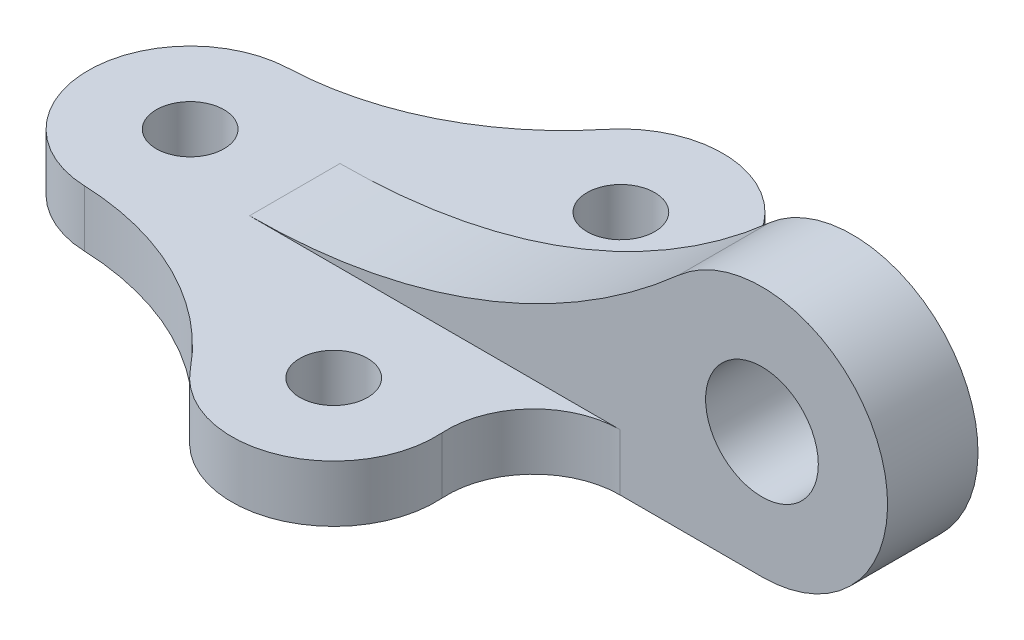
from build123d import *

# Parameters (mm, degrees)
SKETCH1_R      = 5.9944
EXTRUDE1_DEPTH = 10.0076
SKETCH2_R      = 9.9695
EXTRUDE2_DEPTH = 8.001


with BuildPart() as part:
    # Sketch1 → Extrude1 (new body)
    with BuildSketch(Plane(origin=(0, 0, 0), x_dir=(1, 0, 0), z_dir=(0, 1, 0))):
        with BuildLine():
            Line((84.003882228, 8.001), (84.003882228, -8.001))
            ThreePointArc((84.003882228, -8.001), (72.88345621, -12.82016869), (68.795997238, -24.229854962))
            ThreePointArc((68.795997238, -24.229854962), (57.378658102, -42.191260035), (36.798683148, -36.76610234))
            ThreePointArc((36.798683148, -36.76610234), (20.076804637, -23.346390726), (-0.69209176, -18.020714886))
            ThreePointArc((-0.69209176, -18.020714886), (-18.034, 0), (-0.69209176, 18.020714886))
            ThreePointArc((-0.69209176, 18.020714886), (20.076804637, 23.346390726), (36.798683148, 36.76610234))
            ThreePointArc((36.798683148, 36.76610234), (57.378658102, 42.191260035), (68.795997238, 24.229854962))
            ThreePointArc((68.795997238, 24.229854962), (72.88345621, 12.82016869), (84.003882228, 8.001))
        make_face()
        with Locations(Location((50.8, 25.4, 0), (0, 0, 270))):
            Circle(SKETCH1_R, mode=Mode.SUBTRACT)
        with Locations(Location((0, 0, 0), (0, 0, 270))):
            Circle(SKETCH1_R, mode=Mode.SUBTRACT)
        with Locations(Location((50.8, -25.4, 0), (0, 0, 270))):
            Circle(SKETCH1_R, mode=Mode.SUBTRACT)
    extrude(amount=EXTRUDE1_DEPTH)

    # Sketch2 → Extrude2 (add, symmetric)
    with BuildSketch(Plane.XY):
        with BuildLine():
            Line((109.16290824, 0), (18.508518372, 0))
            Line((18.508518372, 0), (18.508518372, 10.0076))
            ThreePointArc((18.508518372, 10.0076), (59.103452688, 17.459383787), (94.405216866, 38.843097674))
            ThreePointArc((94.405216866, 38.843097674), (129.938950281, 30.11845945), (109.16290824, 0))
        make_face()
        with Locations((109.16290824, 22.225)):
            Circle(SKETCH2_R, mode=Mode.SUBTRACT)
    extrude(amount=EXTRUDE2_DEPTH, both=True)


solid = part.part
